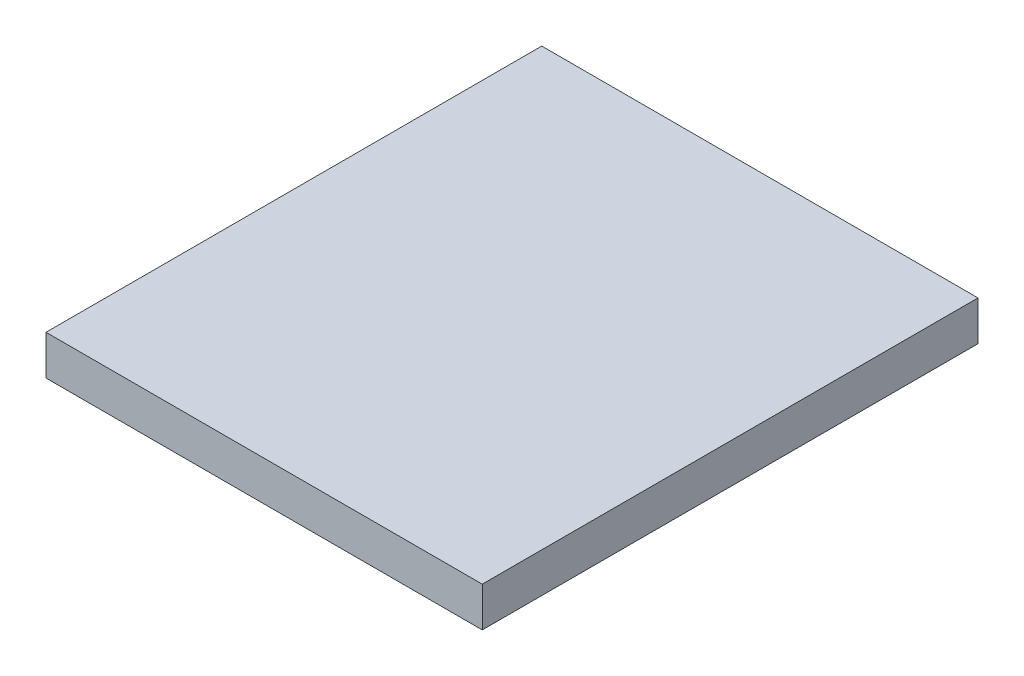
ISO-10303-21;
HEADER;
FILE_DESCRIPTION(('STEP AP214'),'2;1');
FILE_NAME('part.step','',(''),(''),'','','');
FILE_SCHEMA(('AUTOMOTIVE_DESIGN { 1 0 10303 214 1 1 1 1 }'));
ENDSEC;
DATA;
#1=APPLICATION_CONTEXT('core data for automotive mechanical design processes');
#2=APPLICATION_PROTOCOL_DEFINITION('international standard','automotive_design',2000,#1);
#3=PRODUCT_CONTEXT('',#1,'mechanical');
#4=PRODUCT('Part','Part','',(#3));
#5=PRODUCT_RELATED_PRODUCT_CATEGORY('part','',(#4));
#6=PRODUCT_DEFINITION_FORMATION('','',#4);
#7=PRODUCT_DEFINITION_CONTEXT('part definition',#1,'design');
#8=PRODUCT_DEFINITION('design','',#6,#7);
#9=PRODUCT_DEFINITION_SHAPE('','',#8);
#10=(LENGTH_UNIT() NAMED_UNIT(*) SI_UNIT(.MILLI.,.METRE.));
#11=(NAMED_UNIT(*) PLANE_ANGLE_UNIT() SI_UNIT($,.RADIAN.));
#12=(NAMED_UNIT(*) SI_UNIT($,.STERADIAN.) SOLID_ANGLE_UNIT());
#13=UNCERTAINTY_MEASURE_WITH_UNIT(LENGTH_MEASURE(1.E-05),#10,'distance_accuracy_value','');
#14=(GEOMETRIC_REPRESENTATION_CONTEXT(3) GLOBAL_UNCERTAINTY_ASSIGNED_CONTEXT((#13)) GLOBAL_UNIT_ASSIGNED_CONTEXT((#10,
#11,#12)) REPRESENTATION_CONTEXT('',''));
#15=CARTESIAN_POINT('',(0.,0.,0.));
#16=DIRECTION('',(0.,0.,1.));
#17=DIRECTION('',(1.,0.,0.));
#18=AXIS2_PLACEMENT_3D('',#15,#16,#17);
#19=CARTESIAN_POINT('',(220.,40.,250.));
#20=DIRECTION('',(-1.,0.,0.));
#21=DIRECTION('',(0.,0.,1.));
#22=AXIS2_PLACEMENT_3D('',#19,#20,#21);
#23=PLANE('',#22);
#24=DIRECTION('',(0.,0.,-1.));
#25=VECTOR('',#24,1.);
#26=CARTESIAN_POINT('',(220.,0.,250.));
#27=LINE('',#26,#25);
#28=CARTESIAN_POINT('',(220.,0.,250.));
#29=VERTEX_POINT('',#28);
#30=CARTESIAN_POINT('',(220.,0.,-250.));
#31=VERTEX_POINT('',#30);
#32=EDGE_CURVE('E95',#29,#31,#27,.T.);
#33=ORIENTED_EDGE('',*,*,#32,.T.);
#34=DIRECTION('',(0.,-1.,0.));
#35=VECTOR('',#34,1.);
#36=CARTESIAN_POINT('',(220.,40.,-250.));
#37=LINE('',#36,#35);
#38=CARTESIAN_POINT('',(220.,40.,-250.));
#39=VERTEX_POINT('',#38);
#40=EDGE_CURVE('E11',#39,#31,#37,.T.);
#41=ORIENTED_EDGE('',*,*,#40,.F.);
#42=DIRECTION('',(0.,0.,-1.));
#43=VECTOR('',#42,1.);
#44=CARTESIAN_POINT('',(220.,40.,250.));
#45=LINE('',#44,#43);
#46=CARTESIAN_POINT('',(220.,40.,250.));
#47=VERTEX_POINT('',#46);
#48=EDGE_CURVE('E83',#47,#39,#45,.T.);
#49=ORIENTED_EDGE('',*,*,#48,.F.);
#50=DIRECTION('',(0.,-1.,0.));
#51=VECTOR('',#50,1.);
#52=CARTESIAN_POINT('',(220.,40.,250.));
#53=LINE('',#52,#51);
#54=EDGE_CURVE('E91',#47,#29,#53,.T.);
#55=ORIENTED_EDGE('',*,*,#54,.T.);
#56=EDGE_LOOP('',(#33,#41,#49,#55));
#57=FACE_BOUND('',#56,.T.);
#58=ADVANCED_FACE('F32',(#57),#23,.F.);
#59=CARTESIAN_POINT('',(-220.,40.,-250.));
#60=DIRECTION('',(0.,0.,1.));
#61=DIRECTION('',(1.,0.,0.));
#62=AXIS2_PLACEMENT_3D('',#59,#60,#61);
#63=PLANE('',#62);
#64=DIRECTION('',(-1.,0.,0.));
#65=VECTOR('',#64,1.);
#66=CARTESIAN_POINT('',(-220.,0.,-250.));
#67=LINE('',#66,#65);
#68=CARTESIAN_POINT('',(-220.,0.,-250.));
#69=VERTEX_POINT('',#68);
#70=EDGE_CURVE('E87',#31,#69,#67,.T.);
#71=ORIENTED_EDGE('',*,*,#70,.T.);
#72=DIRECTION('',(0.,-1.,0.));
#73=VECTOR('',#72,1.);
#74=CARTESIAN_POINT('',(-220.,40.,-250.));
#75=LINE('',#74,#73);
#76=CARTESIAN_POINT('',(-220.,40.,-250.));
#77=VERTEX_POINT('',#76);
#78=EDGE_CURVE('E40',#77,#69,#75,.T.);
#79=ORIENTED_EDGE('',*,*,#78,.F.);
#80=DIRECTION('',(-1.,0.,0.));
#81=VECTOR('',#80,1.);
#82=CARTESIAN_POINT('',(-220.,40.,-250.));
#83=LINE('',#82,#81);
#84=EDGE_CURVE('E78',#39,#77,#83,.T.);
#85=ORIENTED_EDGE('',*,*,#84,.F.);
#86=ORIENTED_EDGE('',*,*,#40,.T.);
#87=EDGE_LOOP('',(#71,#79,#85,#86));
#88=FACE_BOUND('',#87,.T.);
#89=ADVANCED_FACE('F86',(#88),#63,.F.);
#90=CARTESIAN_POINT('',(-220.,40.,250.));
#91=DIRECTION('',(1.,0.,0.));
#92=DIRECTION('',(0.,0.,-1.));
#93=AXIS2_PLACEMENT_3D('',#90,#91,#92);
#94=PLANE('',#93);
#95=DIRECTION('',(0.,0.,1.));
#96=VECTOR('',#95,1.);
#97=CARTESIAN_POINT('',(-220.,0.,250.));
#98=LINE('',#97,#96);
#99=CARTESIAN_POINT('',(-220.,0.,250.));
#100=VERTEX_POINT('',#99);
#101=EDGE_CURVE('E65',#69,#100,#98,.T.);
#102=ORIENTED_EDGE('',*,*,#101,.T.);
#103=DIRECTION('',(0.,-1.,0.));
#104=VECTOR('',#103,1.);
#105=CARTESIAN_POINT('',(-220.,40.,250.));
#106=LINE('',#105,#104);
#107=CARTESIAN_POINT('',(-220.,40.,250.));
#108=VERTEX_POINT('',#107);
#109=EDGE_CURVE('E88',#108,#100,#106,.T.);
#110=ORIENTED_EDGE('',*,*,#109,.F.);
#111=DIRECTION('',(0.,0.,1.));
#112=VECTOR('',#111,1.);
#113=CARTESIAN_POINT('',(-220.,40.,250.));
#114=LINE('',#113,#112);
#115=EDGE_CURVE('E81',#77,#108,#114,.T.);
#116=ORIENTED_EDGE('',*,*,#115,.F.);
#117=ORIENTED_EDGE('',*,*,#78,.T.);
#118=EDGE_LOOP('',(#102,#110,#116,#117));
#119=FACE_BOUND('',#118,.T.);
#120=ADVANCED_FACE('F89',(#119),#94,.F.);
#121=CARTESIAN_POINT('',(-220.,40.,250.));
#122=DIRECTION('',(0.,0.,-1.));
#123=DIRECTION('',(-1.,0.,0.));
#124=AXIS2_PLACEMENT_3D('',#121,#122,#123);
#125=PLANE('',#124);
#126=DIRECTION('',(1.,0.,0.));
#127=VECTOR('',#126,1.);
#128=CARTESIAN_POINT('',(-220.,0.,250.));
#129=LINE('',#128,#127);
#130=EDGE_CURVE('E71',#100,#29,#129,.T.);
#131=ORIENTED_EDGE('',*,*,#130,.T.);
#132=ORIENTED_EDGE('',*,*,#54,.F.);
#133=DIRECTION('',(1.,0.,0.));
#134=VECTOR('',#133,1.);
#135=CARTESIAN_POINT('',(-220.,40.,250.));
#136=LINE('',#135,#134);
#137=EDGE_CURVE('E48',#108,#47,#136,.T.);
#138=ORIENTED_EDGE('',*,*,#137,.F.);
#139=ORIENTED_EDGE('',*,*,#109,.T.);
#140=EDGE_LOOP('',(#131,#132,#138,#139));
#141=FACE_BOUND('',#140,.T.);
#142=ADVANCED_FACE('F102',(#141),#125,.F.);
#143=CARTESIAN_POINT('',(0.,40.,0.));
#144=DIRECTION('',(0.,-1.,0.));
#145=DIRECTION('',(0.,0.,-1.));
#146=AXIS2_PLACEMENT_3D('',#143,#144,#145);
#147=PLANE('',#146);
#148=ORIENTED_EDGE('',*,*,#48,.T.);
#149=ORIENTED_EDGE('',*,*,#84,.T.);
#150=ORIENTED_EDGE('',*,*,#115,.T.);
#151=ORIENTED_EDGE('',*,*,#137,.T.);
#152=EDGE_LOOP('',(#148,#149,#150,#151));
#153=FACE_BOUND('',#152,.T.);
#154=ADVANCED_FACE('F79',(#153),#147,.F.);
#155=CARTESIAN_POINT('',(0.,0.,0.));
#156=DIRECTION('',(0.,-1.,0.));
#157=DIRECTION('',(0.,0.,-1.));
#158=AXIS2_PLACEMENT_3D('',#155,#156,#157);
#159=PLANE('',#158);
#160=ORIENTED_EDGE('',*,*,#32,.F.);
#161=ORIENTED_EDGE('',*,*,#130,.F.);
#162=ORIENTED_EDGE('',*,*,#101,.F.);
#163=ORIENTED_EDGE('',*,*,#70,.F.);
#164=EDGE_LOOP('',(#160,#161,#162,#163));
#165=FACE_BOUND('',#164,.T.);
#166=ADVANCED_FACE('F105',(#165),#159,.T.);
#167=CLOSED_SHELL('',(#58,#89,#120,#142,#154,#166));
#168=MANIFOLD_SOLID_BREP('B2',#167);
#169=ADVANCED_BREP_SHAPE_REPRESENTATION('',(#18,#168),#14);
#170=SHAPE_DEFINITION_REPRESENTATION(#9,#169);
ENDSEC;
END-ISO-10303-21;
